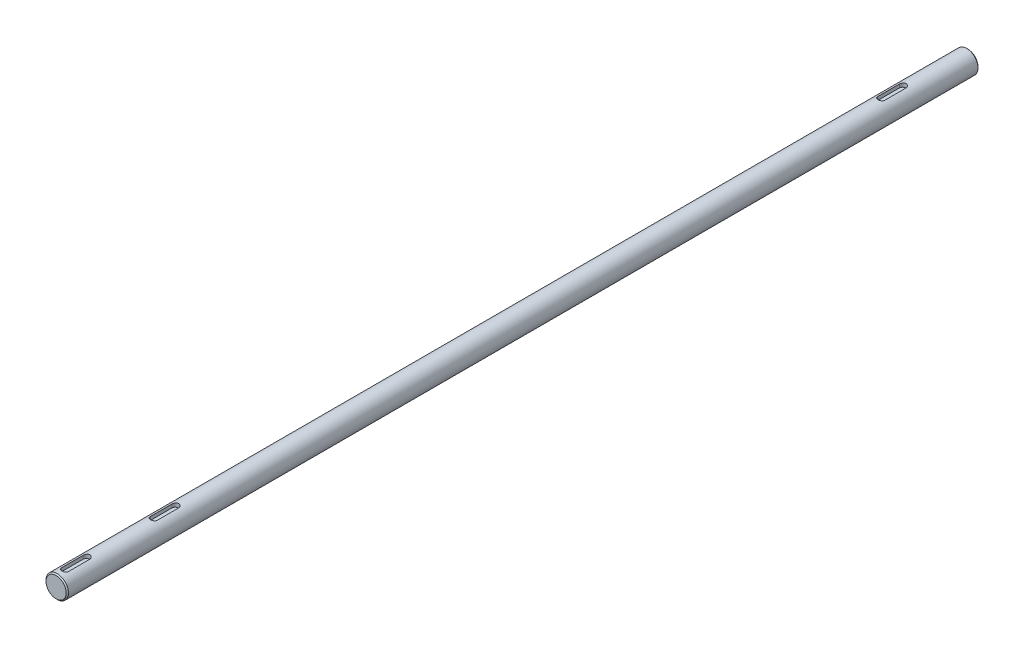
from build123d import *

# Parameters (mm, degrees)
ESQUISSE1_R              = 10
EXTRUSION1_DEPTH         = 405.5
CHANFREIN1_SIZE          = 1
ENL_V_MAT_EXTRU_2_DEPTH  = 3.5
ENL_V_MAT_EXTRU_22_DEPTH = 3.5
ENL_V_MAT_EXTRU_23_DEPTH = 3.5


with BuildPart() as part:
    # Esquisse1 → Extrusion1 (new, symmetric)
    with BuildSketch(Plane.XY):
        with Locations(Location((0, 0, 0), (0, 0, 180))):
            Circle(ESQUISSE1_R)
    extrude(amount=EXTRUSION1_DEPTH, both=True)

    # Chanfrein1
    chanfrein1_edges = [part.edges().sort_by_distance(p)[0] for p in [
        (10, 0, -405.5),
        (10, 0, 405.5),
    ]]
    chamfer(chanfrein1_edges, length=CHANFREIN1_SIZE)

    # Esquisse11 → Enl_v. mat.-Extru.2 (cut)
    with BuildSketch(Plane(origin=(0, 10, 405.5), x_dir=(-1, 0, 0), z_dir=(0, 1, 0))):
        with BuildLine():
            Line((-3, -8), (-3, -27))
            ThreePointArc((-3, -27), (0, -30), (3, -27))
            Line((3, -27), (3, -8))
            ThreePointArc((3, -8), (0, -5), (-3, -8))
        make_face()
    extrude(amount=-ENL_V_MAT_EXTRU_2_DEPTH, mode=Mode.SUBTRACT)

    # Esquisse12 → Enl_v. mat.-Extru.22 (cut)
    with BuildSketch(Plane(origin=(0, 10, 405.5), x_dir=(-1, 0, 0), z_dir=(0, 1, 0))):
        with BuildLine():
            Line((-3, -87), (-3, -106))
            ThreePointArc((-3, -106), (0, -109), (3, -106))
            Line((3, -106), (3, -87))
            ThreePointArc((3, -87), (0, -84), (-3, -87))
        make_face()
    extrude(amount=-ENL_V_MAT_EXTRU_22_DEPTH, mode=Mode.SUBTRACT)

    # Esquisse13 → Enl_v. mat.-Extru.23 (cut)
    with BuildSketch(Plane(origin=(0, 10, -405.5), x_dir=(1, 0, 0), z_dir=(0, 1, 0))):
        with BuildLine():
            Line((-3, -58), (-3, -77))
            ThreePointArc((-3, -77), (0, -80), (3, -77))
            Line((3, -77), (3, -58))
            ThreePointArc((3, -58), (0, -55), (-3, -58))
        make_face()
    extrude(amount=-ENL_V_MAT_EXTRU_23_DEPTH, mode=Mode.SUBTRACT)


solid = part.part
